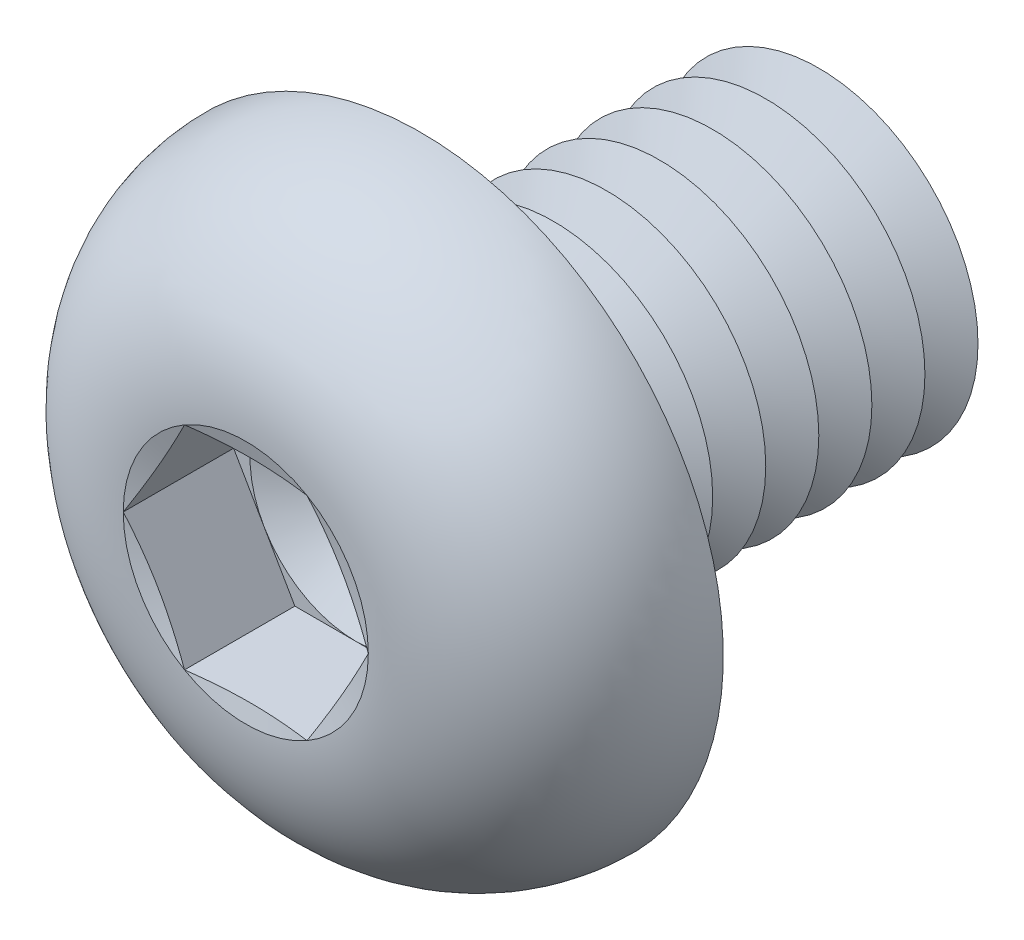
from build123d import *

# Parameters (mm, degrees)
FILLET1_R          = 0.25
LPATTERN1_COUNT    = 8
LPATTERN1_PITCH    = 0.5
CUT_EXTRUDE1_DEPTH = 1.04


with BuildPart() as part:
    # Sketch1 → Revolve1 (revolve)
    with BuildSketch(Plane(origin=(0, 0, 0), x_dir=(0, 0, -1), z_dir=(1, 0, 0)), mode=Mode.PRIVATE) as revolve1_sk:
        with BuildLine():
            Line((0, 1.5), (0, 2.85))
            ThreePointArc((0, 2.85), (-1.182850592, 2.35063849), (-1.65, 1.1547))
            Line((-1.65, 1.1547), (-1.495299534, 0.57735))
            Line((-1.495299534, 0.57735), (-1.65, 0.57735))
            Line((-1.65, 0.57735), (-1.65, 0))
            Line((-1.65, 0), (4, 0))
            Line((4, 0), (4, 1.5))
            Line((4, 1.5), (0, 1.5))
        make_face()
    revolve(revolve1_sk.sketch.rotate(Axis((0, 0, -4), (0, 0, 1)), 90), axis=Axis((0, 0, -4), (0, 0, 1)))

    # Fillet1
    fillet1_edges = [part.edges().sort_by_distance(p)[0] for p in [
        (1.5, 0, 0),
    ]]
    fillet(fillet1_edges, radius=FILLET1_R)

    # Sketch2 → Cut-Revolve1 (revolve, cut)
    with BuildSketch(Plane(origin=(0, 0, 0), x_dir=(0, 0, -1), z_dir=(1, 0, 0)), mode=Mode.PRIVATE) as cut_revolve1_sk:
        Polygon((3.75, 1.5), (4.25, 1.5), (4, 1.066987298), align=None)
    cut_revolve1 = revolve(cut_revolve1_sk.sketch.rotate(Axis((0, 0, -4), (0, 0, -1)), 270), axis=Axis((0, 0, -4), (0, 0, -1)), mode=Mode.SUBTRACT)

    # LPattern1: Cut-Revolve1 ×8
    with Locations(*[(0, 0, i * LPATTERN1_PITCH) for i in range(1, LPATTERN1_COUNT)]):
        add(cut_revolve1, mode=Mode.SUBTRACT)

    # Sketch3 → Cut-Extrude1 (cut)
    with BuildSketch(Plane.XY.offset(1.65)):
        Polygon((0.57735, 0.999999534), (-0.57735, 0.999999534), (-1.1547, 0), (-0.57735, -0.999999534), (0.57735, -0.999999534), (1.1547, 0), align=None)
    extrude(amount=-CUT_EXTRUDE1_DEPTH, mode=Mode.SUBTRACT)

    # Cut-Extrude2 cone 1 section (on through the dimple's axis) → Cut-Extrude2 (revolve, cut)
    with BuildSketch(Plane(origin=(0, 0, 0.61), x_dir=(0, -1, 0), z_dir=(1, 0, 0))):
        Polygon((0, 0), (0.999999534, 0), (0, 0.57735), align=None)
    revolve(axis=Axis((0, 0, 0.61), (0, 0, -1)), mode=Mode.SUBTRACT)


solid = part.part
